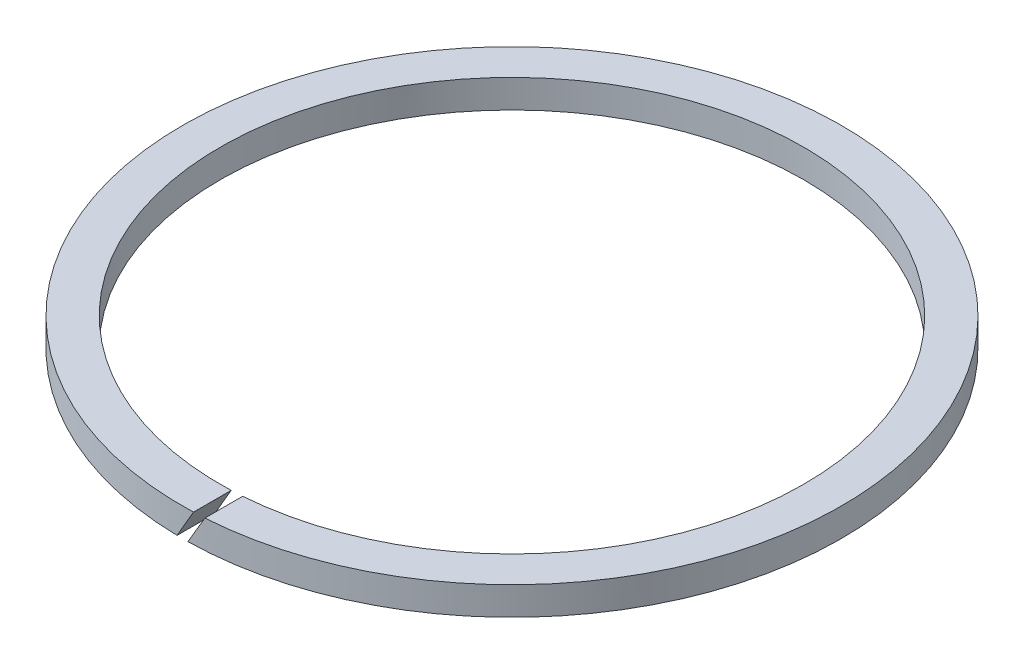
from build123d import *

# Parameters (mm, degrees)
ESQUISSE1_W             = 2
ESQUISSE1_H             = 1.5
ENL_V_MAT_EXTRU_1_DEPTH = 25.794152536


with BuildPart() as part:
    # Esquisse1 → Base-R_volution (revolve)
    with BuildSketch(Plane.XY):
        with Locations((16.5, 0.75)):
            Rectangle(ESQUISSE1_W, ESQUISSE1_H)
    revolve(axis=Axis((0, 50.033968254, 0), (0, -1, 0)))

    # Esquisse2 → Enl_v. mat.-Extru.1 (cut, through all)
    with BuildSketch(Plane.XY):
        Polygon((1.944340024, 2.867695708), (-0.327242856, -1.066801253), (-0.904593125, -1.066801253), (1.366989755, 2.867695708), align=None)
    extrude(amount=ENL_V_MAT_EXTRU_1_DEPTH, mode=Mode.SUBTRACT)


solid = part.part
